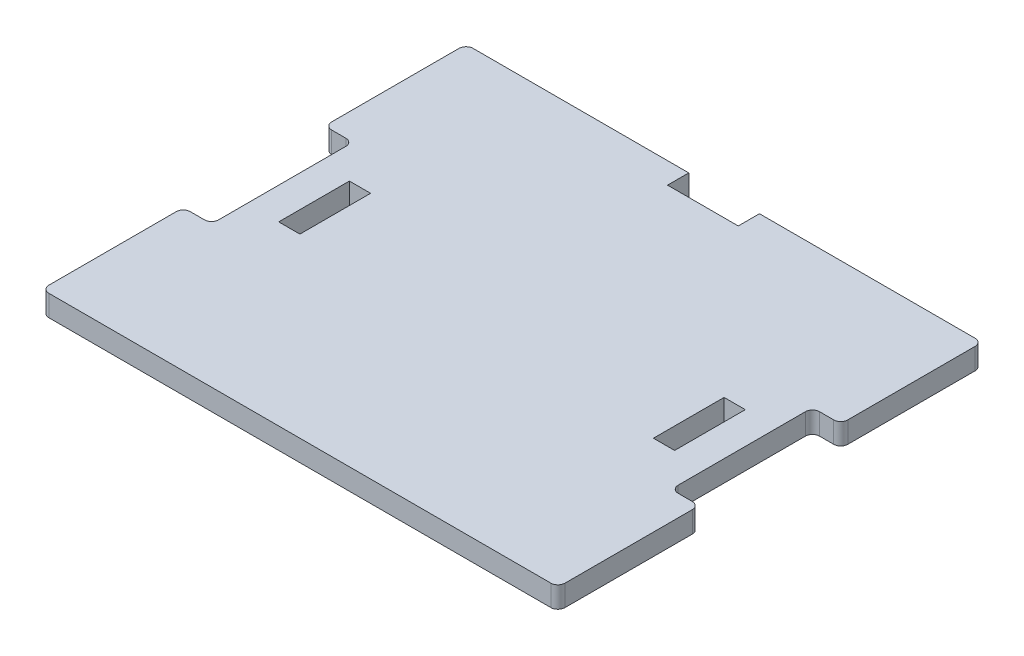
ISO-10303-21;
HEADER;
FILE_DESCRIPTION(('STEP AP214'),'2;1');
FILE_NAME('part.step','',(''),(''),'','','');
FILE_SCHEMA(('AUTOMOTIVE_DESIGN { 1 0 10303 214 1 1 1 1 }'));
ENDSEC;
DATA;
#1=APPLICATION_CONTEXT('core data for automotive mechanical design processes');
#2=APPLICATION_PROTOCOL_DEFINITION('international standard','automotive_design',2000,#1);
#3=PRODUCT_CONTEXT('',#1,'mechanical');
#4=PRODUCT('Part','Part','',(#3));
#5=PRODUCT_RELATED_PRODUCT_CATEGORY('part','',(#4));
#6=PRODUCT_DEFINITION_FORMATION('','',#4);
#7=PRODUCT_DEFINITION_CONTEXT('part definition',#1,'design');
#8=PRODUCT_DEFINITION('design','',#6,#7);
#9=PRODUCT_DEFINITION_SHAPE('','',#8);
#10=(LENGTH_UNIT() NAMED_UNIT(*) SI_UNIT(.MILLI.,.METRE.));
#11=(NAMED_UNIT(*) PLANE_ANGLE_UNIT() SI_UNIT($,.RADIAN.));
#12=(NAMED_UNIT(*) SI_UNIT($,.STERADIAN.) SOLID_ANGLE_UNIT());
#13=UNCERTAINTY_MEASURE_WITH_UNIT(LENGTH_MEASURE(1.E-05),#10,'distance_accuracy_value','');
#14=(GEOMETRIC_REPRESENTATION_CONTEXT(3) GLOBAL_UNCERTAINTY_ASSIGNED_CONTEXT((#13)) GLOBAL_UNIT_ASSIGNED_CONTEXT((#10,
#11,#12)) REPRESENTATION_CONTEXT('',''));
#15=CARTESIAN_POINT('',(0.,0.,0.));
#16=DIRECTION('',(0.,0.,1.));
#17=DIRECTION('',(1.,0.,0.));
#18=AXIS2_PLACEMENT_3D('',#15,#16,#17);
#19=CARTESIAN_POINT('',(0.,6.,-60.));
#20=DIRECTION('',(0.,0.,-1.));
#21=DIRECTION('',(-1.,0.,0.));
#22=AXIS2_PLACEMENT_3D('',#19,#20,#21);
#23=PLANE('',#22);
#24=DIRECTION('',(0.,1.,0.));
#25=VECTOR('',#24,1.);
#26=CARTESIAN_POINT('',(-10.,0.,-60.));
#27=LINE('',#26,#25);
#28=CARTESIAN_POINT('',(-10.,0.,-60.));
#29=VERTEX_POINT('',#28);
#30=CARTESIAN_POINT('',(-10.,6.,-60.));
#31=VERTEX_POINT('',#30);
#32=EDGE_CURVE('E309',#29,#31,#27,.T.);
#33=ORIENTED_EDGE('',*,*,#32,.F.);
#34=DIRECTION('',(1.,0.,0.));
#35=VECTOR('',#34,1.);
#36=CARTESIAN_POINT('',(0.,0.,-60.));
#37=LINE('',#36,#35);
#38=CARTESIAN_POINT('',(-71.,0.,-60.));
#39=VERTEX_POINT('',#38);
#40=EDGE_CURVE('E300',#39,#29,#37,.T.);
#41=ORIENTED_EDGE('',*,*,#40,.F.);
#42=DIRECTION('',(0.,-1.,0.));
#43=VECTOR('',#42,1.);
#44=CARTESIAN_POINT('',(-71.,6.,-60.));
#45=LINE('',#44,#43);
#46=CARTESIAN_POINT('',(-71.,6.,-60.));
#47=VERTEX_POINT('',#46);
#48=EDGE_CURVE('E500',#39,#47,#45,.F.);
#49=ORIENTED_EDGE('',*,*,#48,.T.);
#50=DIRECTION('',(1.,0.,0.));
#51=VECTOR('',#50,1.);
#52=CARTESIAN_POINT('',(0.,6.,-60.));
#53=LINE('',#52,#51);
#54=EDGE_CURVE('E389',#47,#31,#53,.T.);
#55=ORIENTED_EDGE('',*,*,#54,.T.);
#56=EDGE_LOOP('',(#33,#41,#49,#55));
#57=FACE_BOUND('',#56,.T.);
#58=ADVANCED_FACE('F47',(#57),#23,.T.);
#59=CARTESIAN_POINT('',(65.,6.,0.));
#60=DIRECTION('',(1.,0.,0.));
#61=DIRECTION('',(0.,0.,-1.));
#62=AXIS2_PLACEMENT_3D('',#59,#60,#61);
#63=PLANE('',#62);
#64=DIRECTION('',(0.,0.,1.));
#65=VECTOR('',#64,1.);
#66=CARTESIAN_POINT('',(65.,6.,0.));
#67=LINE('',#66,#65);
#68=CARTESIAN_POINT('',(65.,6.,-18.));
#69=VERTEX_POINT('',#68);
#70=CARTESIAN_POINT('',(65.,6.,18.));
#71=VERTEX_POINT('',#70);
#72=EDGE_CURVE('E378',#69,#71,#67,.T.);
#73=ORIENTED_EDGE('',*,*,#72,.T.);
#74=DIRECTION('',(0.,-1.,0.));
#75=VECTOR('',#74,1.);
#76=CARTESIAN_POINT('',(65.,0.,18.));
#77=LINE('',#76,#75);
#78=CARTESIAN_POINT('',(65.,0.,18.));
#79=VERTEX_POINT('',#78);
#80=EDGE_CURVE('E539',#71,#79,#77,.T.);
#81=ORIENTED_EDGE('',*,*,#80,.T.);
#82=DIRECTION('',(0.,0.,1.));
#83=VECTOR('',#82,1.);
#84=CARTESIAN_POINT('',(65.,0.,0.));
#85=LINE('',#84,#83);
#86=CARTESIAN_POINT('',(65.,0.,-18.));
#87=VERTEX_POINT('',#86);
#88=EDGE_CURVE('E377',#87,#79,#85,.T.);
#89=ORIENTED_EDGE('',*,*,#88,.F.);
#90=DIRECTION('',(0.,-1.,0.));
#91=VECTOR('',#90,1.);
#92=CARTESIAN_POINT('',(65.,6.,-18.));
#93=LINE('',#92,#91);
#94=EDGE_CURVE('E537',#87,#69,#93,.F.);
#95=ORIENTED_EDGE('',*,*,#94,.T.);
#96=EDGE_LOOP('',(#73,#81,#89,#95));
#97=FACE_BOUND('',#96,.T.);
#98=ADVANCED_FACE('F559',(#97),#63,.T.);
#99=CARTESIAN_POINT('',(0.,6.,-20.));
#100=DIRECTION('',(0.,0.,-1.));
#101=DIRECTION('',(-1.,0.,0.));
#102=AXIS2_PLACEMENT_3D('',#99,#100,#101);
#103=PLANE('',#102);
#104=DIRECTION('',(1.,0.,0.));
#105=VECTOR('',#104,1.);
#106=CARTESIAN_POINT('',(0.,0.,-20.));
#107=LINE('',#106,#105);
#108=CARTESIAN_POINT('',(67.,0.,-20.));
#109=VERTEX_POINT('',#108);
#110=CARTESIAN_POINT('',(71.,0.,-20.));
#111=VERTEX_POINT('',#110);
#112=EDGE_CURVE('E419',#109,#111,#107,.T.);
#113=ORIENTED_EDGE('',*,*,#112,.T.);
#114=DIRECTION('',(0.,-1.,0.));
#115=VECTOR('',#114,1.);
#116=CARTESIAN_POINT('',(71.,6.,-20.));
#117=LINE('',#116,#115);
#118=CARTESIAN_POINT('',(71.,6.,-20.));
#119=VERTEX_POINT('',#118);
#120=EDGE_CURVE('E530',#111,#119,#117,.F.);
#121=ORIENTED_EDGE('',*,*,#120,.T.);
#122=DIRECTION('',(1.,0.,0.));
#123=VECTOR('',#122,1.);
#124=CARTESIAN_POINT('',(0.,6.,-20.));
#125=LINE('',#124,#123);
#126=CARTESIAN_POINT('',(67.,6.,-20.));
#127=VERTEX_POINT('',#126);
#128=EDGE_CURVE('E381',#127,#119,#125,.T.);
#129=ORIENTED_EDGE('',*,*,#128,.F.);
#130=DIRECTION('',(0.,-1.,0.));
#131=VECTOR('',#130,1.);
#132=CARTESIAN_POINT('',(67.,6.,-20.));
#133=LINE('',#132,#131);
#134=EDGE_CURVE('E527',#127,#109,#133,.T.);
#135=ORIENTED_EDGE('',*,*,#134,.T.);
#136=EDGE_LOOP('',(#113,#121,#129,#135));
#137=FACE_BOUND('',#136,.T.);
#138=ADVANCED_FACE('F569',(#137),#103,.F.);
#139=CARTESIAN_POINT('',(73.,6.,0.));
#140=DIRECTION('',(-1.,0.,0.));
#141=DIRECTION('',(0.,0.,1.));
#142=AXIS2_PLACEMENT_3D('',#139,#140,#141);
#143=PLANE('',#142);
#144=DIRECTION('',(0.,0.,-1.));
#145=VECTOR('',#144,1.);
#146=CARTESIAN_POINT('',(73.,0.,0.));
#147=LINE('',#146,#145);
#148=CARTESIAN_POINT('',(73.,0.,-22.));
#149=VERTEX_POINT('',#148);
#150=CARTESIAN_POINT('',(73.,0.,-58.));
#151=VERTEX_POINT('',#150);
#152=EDGE_CURVE('E422',#149,#151,#147,.T.);
#153=ORIENTED_EDGE('',*,*,#152,.T.);
#154=DIRECTION('',(0.,-1.,0.));
#155=VECTOR('',#154,1.);
#156=CARTESIAN_POINT('',(73.,6.,-58.));
#157=LINE('',#156,#155);
#158=CARTESIAN_POINT('',(73.,6.,-58.));
#159=VERTEX_POINT('',#158);
#160=EDGE_CURVE('E525',#151,#159,#157,.F.);
#161=ORIENTED_EDGE('',*,*,#160,.T.);
#162=DIRECTION('',(0.,0.,-1.));
#163=VECTOR('',#162,1.);
#164=CARTESIAN_POINT('',(73.,6.,0.));
#165=LINE('',#164,#163);
#166=CARTESIAN_POINT('',(73.,6.,-22.));
#167=VERTEX_POINT('',#166);
#168=EDGE_CURVE('E385',#167,#159,#165,.T.);
#169=ORIENTED_EDGE('',*,*,#168,.F.);
#170=DIRECTION('',(0.,-1.,0.));
#171=VECTOR('',#170,1.);
#172=CARTESIAN_POINT('',(73.,6.,-22.));
#173=LINE('',#172,#171);
#174=EDGE_CURVE('E522',#167,#149,#173,.T.);
#175=ORIENTED_EDGE('',*,*,#174,.T.);
#176=EDGE_LOOP('',(#153,#161,#169,#175));
#177=FACE_BOUND('',#176,.T.);
#178=ADVANCED_FACE('F577',(#177),#143,.F.);
#179=DIRECTION('',(0.,1.,0.));
#180=VECTOR('',#179,1.);
#181=CARTESIAN_POINT('',(10.,0.,-60.));
#182=LINE('',#181,#180);
#183=CARTESIAN_POINT('',(10.,0.,-60.));
#184=VERTEX_POINT('',#183);
#185=CARTESIAN_POINT('',(10.,6.,-60.));
#186=VERTEX_POINT('',#185);
#187=EDGE_CURVE('E312',#184,#186,#182,.T.);
#188=ORIENTED_EDGE('',*,*,#187,.T.);
#189=CARTESIAN_POINT('',(71.,6.,-60.));
#190=VERTEX_POINT('',#189);
#191=EDGE_CURVE('E388',#186,#190,#53,.T.);
#192=ORIENTED_EDGE('',*,*,#191,.T.);
#193=DIRECTION('',(0.,-1.,0.));
#194=VECTOR('',#193,1.);
#195=CARTESIAN_POINT('',(71.,0.,-60.));
#196=LINE('',#195,#194);
#197=CARTESIAN_POINT('',(71.,0.,-60.));
#198=VERTEX_POINT('',#197);
#199=EDGE_CURVE('E497',#190,#198,#196,.T.);
#200=ORIENTED_EDGE('',*,*,#199,.T.);
#201=EDGE_CURVE('E425',#184,#198,#37,.T.);
#202=ORIENTED_EDGE('',*,*,#201,.F.);
#203=EDGE_LOOP('',(#188,#192,#200,#202));
#204=FACE_BOUND('',#203,.T.);
#205=ADVANCED_FACE('F587',(#204),#23,.T.);
#206=CARTESIAN_POINT('',(-73.,6.,0.));
#207=DIRECTION('',(-1.,0.,0.));
#208=DIRECTION('',(0.,0.,1.));
#209=AXIS2_PLACEMENT_3D('',#206,#207,#208);
#210=PLANE('',#209);
#211=DIRECTION('',(0.,0.,-1.));
#212=VECTOR('',#211,1.);
#213=CARTESIAN_POINT('',(-73.,0.,0.));
#214=LINE('',#213,#212);
#215=CARTESIAN_POINT('',(-73.,0.,-22.));
#216=VERTEX_POINT('',#215);
#217=CARTESIAN_POINT('',(-73.,0.,-58.));
#218=VERTEX_POINT('',#217);
#219=EDGE_CURVE('E427',#216,#218,#214,.T.);
#220=ORIENTED_EDGE('',*,*,#219,.F.);
#221=DIRECTION('',(0.,-1.,0.));
#222=VECTOR('',#221,1.);
#223=CARTESIAN_POINT('',(-73.,6.,-22.));
#224=LINE('',#223,#222);
#225=CARTESIAN_POINT('',(-73.,6.,-22.));
#226=VERTEX_POINT('',#225);
#227=EDGE_CURVE('E473',#216,#226,#224,.F.);
#228=ORIENTED_EDGE('',*,*,#227,.T.);
#229=DIRECTION('',(0.,0.,-1.));
#230=VECTOR('',#229,1.);
#231=CARTESIAN_POINT('',(-73.,6.,0.));
#232=LINE('',#231,#230);
#233=CARTESIAN_POINT('',(-73.,6.,-58.));
#234=VERTEX_POINT('',#233);
#235=EDGE_CURVE('E392',#226,#234,#232,.T.);
#236=ORIENTED_EDGE('',*,*,#235,.T.);
#237=DIRECTION('',(0.,-1.,0.));
#238=VECTOR('',#237,1.);
#239=CARTESIAN_POINT('',(-73.,6.,-58.));
#240=LINE('',#239,#238);
#241=EDGE_CURVE('E470',#234,#218,#240,.T.);
#242=ORIENTED_EDGE('',*,*,#241,.T.);
#243=EDGE_LOOP('',(#220,#228,#236,#242));
#244=FACE_BOUND('',#243,.T.);
#245=ADVANCED_FACE('F601',(#244),#210,.T.);
#246=CARTESIAN_POINT('',(0.,6.,-20.));
#247=DIRECTION('',(0.,0.,1.));
#248=DIRECTION('',(1.,0.,0.));
#249=AXIS2_PLACEMENT_3D('',#246,#247,#248);
#250=PLANE('',#249);
#251=DIRECTION('',(-1.,0.,0.));
#252=VECTOR('',#251,1.);
#253=CARTESIAN_POINT('',(0.,6.,-20.));
#254=LINE('',#253,#252);
#255=CARTESIAN_POINT('',(-67.,6.,-20.));
#256=VERTEX_POINT('',#255);
#257=CARTESIAN_POINT('',(-71.,6.,-20.));
#258=VERTEX_POINT('',#257);
#259=EDGE_CURVE('E395',#256,#258,#254,.T.);
#260=ORIENTED_EDGE('',*,*,#259,.T.);
#261=DIRECTION('',(0.,-1.,0.));
#262=VECTOR('',#261,1.);
#263=CARTESIAN_POINT('',(-71.,6.,-20.));
#264=LINE('',#263,#262);
#265=CARTESIAN_POINT('',(-71.,0.,-20.));
#266=VERTEX_POINT('',#265);
#267=EDGE_CURVE('E451',#258,#266,#264,.T.);
#268=ORIENTED_EDGE('',*,*,#267,.T.);
#269=DIRECTION('',(-1.,0.,0.));
#270=VECTOR('',#269,1.);
#271=CARTESIAN_POINT('',(0.,0.,-20.));
#272=LINE('',#271,#270);
#273=CARTESIAN_POINT('',(-67.,0.,-20.));
#274=VERTEX_POINT('',#273);
#275=EDGE_CURVE('E430',#274,#266,#272,.T.);
#276=ORIENTED_EDGE('',*,*,#275,.F.);
#277=DIRECTION('',(0.,-1.,0.));
#278=VECTOR('',#277,1.);
#279=CARTESIAN_POINT('',(-67.,6.,-20.));
#280=LINE('',#279,#278);
#281=EDGE_CURVE('E416',#274,#256,#280,.F.);
#282=ORIENTED_EDGE('',*,*,#281,.T.);
#283=EDGE_LOOP('',(#260,#268,#276,#282));
#284=FACE_BOUND('',#283,.T.);
#285=ADVANCED_FACE('F609',(#284),#250,.T.);
#286=CARTESIAN_POINT('',(-65.,6.,0.));
#287=DIRECTION('',(1.,0.,0.));
#288=DIRECTION('',(0.,0.,-1.));
#289=AXIS2_PLACEMENT_3D('',#286,#287,#288);
#290=PLANE('',#289);
#291=DIRECTION('',(0.,0.,1.));
#292=VECTOR('',#291,1.);
#293=CARTESIAN_POINT('',(-65.,6.,0.));
#294=LINE('',#293,#292);
#295=CARTESIAN_POINT('',(-65.,6.,-18.));
#296=VERTEX_POINT('',#295);
#297=CARTESIAN_POINT('',(-65.,6.,18.));
#298=VERTEX_POINT('',#297);
#299=EDGE_CURVE('E398',#296,#298,#294,.T.);
#300=ORIENTED_EDGE('',*,*,#299,.F.);
#301=DIRECTION('',(0.,-1.,0.));
#302=VECTOR('',#301,1.);
#303=CARTESIAN_POINT('',(-65.,6.,-18.));
#304=LINE('',#303,#302);
#305=CARTESIAN_POINT('',(-65.,0.,-18.));
#306=VERTEX_POINT('',#305);
#307=EDGE_CURVE('E494',#296,#306,#304,.T.);
#308=ORIENTED_EDGE('',*,*,#307,.T.);
#309=DIRECTION('',(0.,0.,1.));
#310=VECTOR('',#309,1.);
#311=CARTESIAN_POINT('',(-65.,0.,0.));
#312=LINE('',#311,#310);
#313=CARTESIAN_POINT('',(-65.,0.,18.));
#314=VERTEX_POINT('',#313);
#315=EDGE_CURVE('E433',#306,#314,#312,.T.);
#316=ORIENTED_EDGE('',*,*,#315,.T.);
#317=DIRECTION('',(0.,-1.,0.));
#318=VECTOR('',#317,1.);
#319=CARTESIAN_POINT('',(-65.,6.,18.));
#320=LINE('',#319,#318);
#321=EDGE_CURVE('E492',#314,#298,#320,.F.);
#322=ORIENTED_EDGE('',*,*,#321,.T.);
#323=EDGE_LOOP('',(#300,#308,#316,#322));
#324=FACE_BOUND('',#323,.T.);
#325=ADVANCED_FACE('F618',(#324),#290,.F.);
#326=CARTESIAN_POINT('',(0.,6.,19.9999999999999));
#327=DIRECTION('',(0.,0.,1.));
#328=DIRECTION('',(1.,0.,0.));
#329=AXIS2_PLACEMENT_3D('',#326,#327,#328);
#330=PLANE('',#329);
#331=DIRECTION('',(-1.,0.,0.));
#332=VECTOR('',#331,1.);
#333=CARTESIAN_POINT('',(0.,0.,19.9999999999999));
#334=LINE('',#333,#332);
#335=CARTESIAN_POINT('',(-67.,0.,20.));
#336=VERTEX_POINT('',#335);
#337=CARTESIAN_POINT('',(-71.,0.,20.));
#338=VERTEX_POINT('',#337);
#339=EDGE_CURVE('E436',#336,#338,#334,.T.);
#340=ORIENTED_EDGE('',*,*,#339,.T.);
#341=DIRECTION('',(0.,-1.,0.));
#342=VECTOR('',#341,1.);
#343=CARTESIAN_POINT('',(-71.,6.,20.));
#344=LINE('',#343,#342);
#345=CARTESIAN_POINT('',(-71.,6.,20.));
#346=VERTEX_POINT('',#345);
#347=EDGE_CURVE('E510',#338,#346,#344,.F.);
#348=ORIENTED_EDGE('',*,*,#347,.T.);
#349=DIRECTION('',(-1.,0.,0.));
#350=VECTOR('',#349,1.);
#351=CARTESIAN_POINT('',(0.,6.,19.9999999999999));
#352=LINE('',#351,#350);
#353=CARTESIAN_POINT('',(-67.,6.,20.));
#354=VERTEX_POINT('',#353);
#355=EDGE_CURVE('E401',#354,#346,#352,.T.);
#356=ORIENTED_EDGE('',*,*,#355,.F.);
#357=DIRECTION('',(0.,-1.,0.));
#358=VECTOR('',#357,1.);
#359=CARTESIAN_POINT('',(-67.,0.,20.));
#360=LINE('',#359,#358);
#361=EDGE_CURVE('E507',#354,#336,#360,.T.);
#362=ORIENTED_EDGE('',*,*,#361,.T.);
#363=EDGE_LOOP('',(#340,#348,#356,#362));
#364=FACE_BOUND('',#363,.T.);
#365=ADVANCED_FACE('F627',(#364),#330,.F.);
#366=CARTESIAN_POINT('',(-73.,6.,0.));
#367=DIRECTION('',(1.,0.,0.));
#368=DIRECTION('',(0.,0.,-1.));
#369=AXIS2_PLACEMENT_3D('',#366,#367,#368);
#370=PLANE('',#369);
#371=DIRECTION('',(0.,0.,1.));
#372=VECTOR('',#371,1.);
#373=CARTESIAN_POINT('',(-73.,6.,0.));
#374=LINE('',#373,#372);
#375=CARTESIAN_POINT('',(-73.,6.,22.));
#376=VERTEX_POINT('',#375);
#377=CARTESIAN_POINT('',(-73.,6.,58.));
#378=VERTEX_POINT('',#377);
#379=EDGE_CURVE('E404',#376,#378,#374,.T.);
#380=ORIENTED_EDGE('',*,*,#379,.F.);
#381=DIRECTION('',(0.,-1.,0.));
#382=VECTOR('',#381,1.);
#383=CARTESIAN_POINT('',(-73.,6.,22.));
#384=LINE('',#383,#382);
#385=CARTESIAN_POINT('',(-73.,0.,22.));
#386=VERTEX_POINT('',#385);
#387=EDGE_CURVE('E504',#376,#386,#384,.T.);
#388=ORIENTED_EDGE('',*,*,#387,.T.);
#389=DIRECTION('',(0.,0.,1.));
#390=VECTOR('',#389,1.);
#391=CARTESIAN_POINT('',(-73.,0.,0.));
#392=LINE('',#391,#390);
#393=CARTESIAN_POINT('',(-73.,0.,58.));
#394=VERTEX_POINT('',#393);
#395=EDGE_CURVE('E439',#386,#394,#392,.T.);
#396=ORIENTED_EDGE('',*,*,#395,.T.);
#397=DIRECTION('',(0.,-1.,0.));
#398=VECTOR('',#397,1.);
#399=CARTESIAN_POINT('',(-73.,6.,58.));
#400=LINE('',#399,#398);
#401=EDGE_CURVE('E502',#394,#378,#400,.F.);
#402=ORIENTED_EDGE('',*,*,#401,.T.);
#403=EDGE_LOOP('',(#380,#388,#396,#402));
#404=FACE_BOUND('',#403,.T.);
#405=ADVANCED_FACE('F636',(#404),#370,.F.);
#406=CARTESIAN_POINT('',(0.,6.,60.));
#407=DIRECTION('',(0.,0.,-1.));
#408=DIRECTION('',(-1.,0.,0.));
#409=AXIS2_PLACEMENT_3D('',#406,#407,#408);
#410=PLANE('',#409);
#411=DIRECTION('',(1.,0.,0.));
#412=VECTOR('',#411,1.);
#413=CARTESIAN_POINT('',(0.,6.,60.));
#414=LINE('',#413,#412);
#415=CARTESIAN_POINT('',(-71.,6.,60.));
#416=VERTEX_POINT('',#415);
#417=CARTESIAN_POINT('',(71.,6.,60.));
#418=VERTEX_POINT('',#417);
#419=EDGE_CURVE('E407',#416,#418,#414,.T.);
#420=ORIENTED_EDGE('',*,*,#419,.F.);
#421=DIRECTION('',(0.,-1.,0.));
#422=VECTOR('',#421,1.);
#423=CARTESIAN_POINT('',(-71.,6.,60.));
#424=LINE('',#423,#422);
#425=CARTESIAN_POINT('',(-71.,0.,60.));
#426=VERTEX_POINT('',#425);
#427=EDGE_CURVE('E514',#416,#426,#424,.T.);
#428=ORIENTED_EDGE('',*,*,#427,.T.);
#429=DIRECTION('',(1.,0.,0.));
#430=VECTOR('',#429,1.);
#431=CARTESIAN_POINT('',(0.,0.,60.));
#432=LINE('',#431,#430);
#433=CARTESIAN_POINT('',(71.,0.,60.));
#434=VERTEX_POINT('',#433);
#435=EDGE_CURVE('E442',#426,#434,#432,.T.);
#436=ORIENTED_EDGE('',*,*,#435,.T.);
#437=DIRECTION('',(0.,-1.,0.));
#438=VECTOR('',#437,1.);
#439=CARTESIAN_POINT('',(71.,6.,60.));
#440=LINE('',#439,#438);
#441=EDGE_CURVE('E512',#434,#418,#440,.F.);
#442=ORIENTED_EDGE('',*,*,#441,.T.);
#443=EDGE_LOOP('',(#420,#428,#436,#442));
#444=FACE_BOUND('',#443,.T.);
#445=ADVANCED_FACE('F645',(#444),#410,.F.);
#446=CARTESIAN_POINT('',(73.,6.,0.));
#447=DIRECTION('',(1.,0.,0.));
#448=DIRECTION('',(0.,0.,-1.));
#449=AXIS2_PLACEMENT_3D('',#446,#447,#448);
#450=PLANE('',#449);
#451=DIRECTION('',(0.,0.,1.));
#452=VECTOR('',#451,1.);
#453=CARTESIAN_POINT('',(73.,6.,0.));
#454=LINE('',#453,#452);
#455=CARTESIAN_POINT('',(73.,6.,22.));
#456=VERTEX_POINT('',#455);
#457=CARTESIAN_POINT('',(73.,6.,58.));
#458=VERTEX_POINT('',#457);
#459=EDGE_CURVE('E410',#456,#458,#454,.T.);
#460=ORIENTED_EDGE('',*,*,#459,.T.);
#461=DIRECTION('',(0.,-1.,0.));
#462=VECTOR('',#461,1.);
#463=CARTESIAN_POINT('',(73.,0.,58.));
#464=LINE('',#463,#462);
#465=CARTESIAN_POINT('',(73.,0.,58.));
#466=VERTEX_POINT('',#465);
#467=EDGE_CURVE('E519',#458,#466,#464,.T.);
#468=ORIENTED_EDGE('',*,*,#467,.T.);
#469=DIRECTION('',(0.,0.,1.));
#470=VECTOR('',#469,1.);
#471=CARTESIAN_POINT('',(73.,0.,0.));
#472=LINE('',#471,#470);
#473=CARTESIAN_POINT('',(73.,0.,22.));
#474=VERTEX_POINT('',#473);
#475=EDGE_CURVE('E445',#474,#466,#472,.T.);
#476=ORIENTED_EDGE('',*,*,#475,.F.);
#477=DIRECTION('',(0.,-1.,0.));
#478=VECTOR('',#477,1.);
#479=CARTESIAN_POINT('',(73.,6.,22.));
#480=LINE('',#479,#478);
#481=EDGE_CURVE('E517',#474,#456,#480,.F.);
#482=ORIENTED_EDGE('',*,*,#481,.T.);
#483=EDGE_LOOP('',(#460,#468,#476,#482));
#484=FACE_BOUND('',#483,.T.);
#485=ADVANCED_FACE('F654',(#484),#450,.T.);
#486=CARTESIAN_POINT('',(0.,6.,19.9999999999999));
#487=DIRECTION('',(0.,0.,-1.));
#488=DIRECTION('',(-1.,0.,0.));
#489=AXIS2_PLACEMENT_3D('',#486,#487,#488);
#490=PLANE('',#489);
#491=DIRECTION('',(1.,0.,0.));
#492=VECTOR('',#491,1.);
#493=CARTESIAN_POINT('',(0.,6.,19.9999999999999));
#494=LINE('',#493,#492);
#495=CARTESIAN_POINT('',(67.,6.,20.));
#496=VERTEX_POINT('',#495);
#497=CARTESIAN_POINT('',(71.,6.,20.));
#498=VERTEX_POINT('',#497);
#499=EDGE_CURVE('E413',#496,#498,#494,.T.);
#500=ORIENTED_EDGE('',*,*,#499,.T.);
#501=DIRECTION('',(0.,-1.,0.));
#502=VECTOR('',#501,1.);
#503=CARTESIAN_POINT('',(71.,6.,20.));
#504=LINE('',#503,#502);
#505=CARTESIAN_POINT('',(71.,0.,20.));
#506=VERTEX_POINT('',#505);
#507=EDGE_CURVE('E534',#498,#506,#504,.T.);
#508=ORIENTED_EDGE('',*,*,#507,.T.);
#509=DIRECTION('',(1.,0.,0.));
#510=VECTOR('',#509,1.);
#511=CARTESIAN_POINT('',(0.,0.,19.9999999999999));
#512=LINE('',#511,#510);
#513=CARTESIAN_POINT('',(67.,0.,20.));
#514=VERTEX_POINT('',#513);
#515=EDGE_CURVE('E382',#514,#506,#512,.T.);
#516=ORIENTED_EDGE('',*,*,#515,.F.);
#517=DIRECTION('',(0.,-1.,0.));
#518=VECTOR('',#517,1.);
#519=CARTESIAN_POINT('',(67.,6.,20.));
#520=LINE('',#519,#518);
#521=EDGE_CURVE('E532',#514,#496,#520,.F.);
#522=ORIENTED_EDGE('',*,*,#521,.T.);
#523=EDGE_LOOP('',(#500,#508,#516,#522));
#524=FACE_BOUND('',#523,.T.);
#525=ADVANCED_FACE('F663',(#524),#490,.T.);
#526=CARTESIAN_POINT('',(0.,6.,0.));
#527=DIRECTION('',(0.,1.,0.));
#528=DIRECTION('',(0.,0.,1.));
#529=AXIS2_PLACEMENT_3D('',#526,#527,#528);
#530=PLANE('',#529);
#531=DIRECTION('',(0.,0.,1.));
#532=VECTOR('',#531,1.);
#533=CARTESIAN_POINT('',(-10.,6.,-60.));
#534=LINE('',#533,#532);
#535=CARTESIAN_POINT('',(-9.99999999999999,6.,-54.));
#536=VERTEX_POINT('',#535);
#537=EDGE_CURVE('E285',#31,#536,#534,.T.);
#538=ORIENTED_EDGE('',*,*,#537,.F.);
#539=ORIENTED_EDGE('',*,*,#54,.F.);
#540=CARTESIAN_POINT('',(-71.,6.,-58.));
#541=DIRECTION('',(0.,1.,0.));
#542=DIRECTION('',(0.,0.,1.));
#543=AXIS2_PLACEMENT_3D('',#540,#541,#542);
#544=CIRCLE('',#543,2.);
#545=EDGE_CURVE('E488',#47,#234,#544,.T.);
#546=ORIENTED_EDGE('',*,*,#545,.T.);
#547=ORIENTED_EDGE('',*,*,#235,.F.);
#548=CARTESIAN_POINT('',(-71.,6.,-22.));
#549=DIRECTION('',(0.,1.,0.));
#550=DIRECTION('',(0.,0.,1.));
#551=AXIS2_PLACEMENT_3D('',#548,#549,#550);
#552=CIRCLE('',#551,2.);
#553=EDGE_CURVE('E490',#226,#258,#552,.T.);
#554=ORIENTED_EDGE('',*,*,#553,.T.);
#555=ORIENTED_EDGE('',*,*,#259,.F.);
#556=CARTESIAN_POINT('',(-67.,6.,-18.));
#557=DIRECTION('',(0.,1.,0.));
#558=DIRECTION('',(0.,0.,1.));
#559=AXIS2_PLACEMENT_3D('',#556,#557,#558);
#560=CIRCLE('',#559,2.);
#561=EDGE_CURVE('E544',#256,#296,#560,.F.);
#562=ORIENTED_EDGE('',*,*,#561,.T.);
#563=ORIENTED_EDGE('',*,*,#299,.T.);
#564=CARTESIAN_POINT('',(-67.,6.,18.));
#565=DIRECTION('',(0.,1.,0.));
#566=DIRECTION('',(0.,0.,1.));
#567=AXIS2_PLACEMENT_3D('',#564,#565,#566);
#568=CIRCLE('',#567,2.);
#569=EDGE_CURVE('E548',#298,#354,#568,.F.);
#570=ORIENTED_EDGE('',*,*,#569,.T.);
#571=ORIENTED_EDGE('',*,*,#355,.T.);
#572=CARTESIAN_POINT('',(-71.,6.,22.));
#573=DIRECTION('',(0.,1.,0.));
#574=DIRECTION('',(0.,0.,1.));
#575=AXIS2_PLACEMENT_3D('',#572,#573,#574);
#576=CIRCLE('',#575,2.);
#577=EDGE_CURVE('E486',#346,#376,#576,.T.);
#578=ORIENTED_EDGE('',*,*,#577,.T.);
#579=ORIENTED_EDGE('',*,*,#379,.T.);
#580=CARTESIAN_POINT('',(-71.,6.,58.));
#581=DIRECTION('',(0.,1.,0.));
#582=DIRECTION('',(0.,0.,1.));
#583=AXIS2_PLACEMENT_3D('',#580,#581,#582);
#584=CIRCLE('',#583,2.);
#585=EDGE_CURVE('E484',#378,#416,#584,.T.);
#586=ORIENTED_EDGE('',*,*,#585,.T.);
#587=ORIENTED_EDGE('',*,*,#419,.T.);
#588=CARTESIAN_POINT('',(71.,6.,58.));
#589=DIRECTION('',(0.,1.,0.));
#590=DIRECTION('',(0.,0.,1.));
#591=AXIS2_PLACEMENT_3D('',#588,#589,#590);
#592=CIRCLE('',#591,2.);
#593=EDGE_CURVE('E482',#418,#458,#592,.T.);
#594=ORIENTED_EDGE('',*,*,#593,.T.);
#595=ORIENTED_EDGE('',*,*,#459,.F.);
#596=CARTESIAN_POINT('',(71.,6.,22.));
#597=DIRECTION('',(0.,1.,0.));
#598=DIRECTION('',(0.,0.,1.));
#599=AXIS2_PLACEMENT_3D('',#596,#597,#598);
#600=CIRCLE('',#599,2.);
#601=EDGE_CURVE('E475',#456,#498,#600,.T.);
#602=ORIENTED_EDGE('',*,*,#601,.T.);
#603=ORIENTED_EDGE('',*,*,#499,.F.);
#604=CARTESIAN_POINT('',(67.,6.,18.));
#605=DIRECTION('',(0.,1.,0.));
#606=DIRECTION('',(0.,0.,1.));
#607=AXIS2_PLACEMENT_3D('',#604,#605,#606);
#608=CIRCLE('',#607,2.);
#609=EDGE_CURVE('E552',#496,#71,#608,.F.);
#610=ORIENTED_EDGE('',*,*,#609,.T.);
#611=ORIENTED_EDGE('',*,*,#72,.F.);
#612=CARTESIAN_POINT('',(67.,6.,-18.));
#613=DIRECTION('',(0.,1.,0.));
#614=DIRECTION('',(0.,0.,1.));
#615=AXIS2_PLACEMENT_3D('',#612,#613,#614);
#616=CIRCLE('',#615,2.);
#617=EDGE_CURVE('E11',#69,#127,#616,.F.);
#618=ORIENTED_EDGE('',*,*,#617,.T.);
#619=ORIENTED_EDGE('',*,*,#128,.T.);
#620=CARTESIAN_POINT('',(71.,6.,-22.));
#621=DIRECTION('',(0.,1.,0.));
#622=DIRECTION('',(0.,0.,1.));
#623=AXIS2_PLACEMENT_3D('',#620,#621,#622);
#624=CIRCLE('',#623,2.);
#625=EDGE_CURVE('E477',#119,#167,#624,.T.);
#626=ORIENTED_EDGE('',*,*,#625,.T.);
#627=ORIENTED_EDGE('',*,*,#168,.T.);
#628=CARTESIAN_POINT('',(71.,6.,-58.));
#629=DIRECTION('',(0.,1.,0.));
#630=DIRECTION('',(0.,0.,1.));
#631=AXIS2_PLACEMENT_3D('',#628,#629,#630);
#632=CIRCLE('',#631,2.);
#633=EDGE_CURVE('E479',#159,#190,#632,.T.);
#634=ORIENTED_EDGE('',*,*,#633,.T.);
#635=ORIENTED_EDGE('',*,*,#191,.F.);
#636=DIRECTION('',(0.,0.,-1.));
#637=VECTOR('',#636,1.);
#638=CARTESIAN_POINT('',(10.,6.,-60.));
#639=LINE('',#638,#637);
#640=CARTESIAN_POINT('',(10.,6.,-54.));
#641=VERTEX_POINT('',#640);
#642=EDGE_CURVE('E301',#641,#186,#639,.T.);
#643=ORIENTED_EDGE('',*,*,#642,.F.);
#644=DIRECTION('',(1.,0.,0.));
#645=VECTOR('',#644,1.);
#646=CARTESIAN_POINT('',(-9.99999999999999,6.,-54.));
#647=LINE('',#646,#645);
#648=EDGE_CURVE('E303',#536,#641,#647,.T.);
#649=ORIENTED_EDGE('',*,*,#648,.F.);
#650=EDGE_LOOP('',(#538,#539,#546,#547,#554,#555,#562,#563,#570,#571,#578,#579,#586,#587,#594,
#595,#602,#603,#610,#611,#618,#619,#626,#627,#634,#635,#643,#649));
#651=FACE_BOUND('',#650,.T.);
#652=DIRECTION('',(0.,0.,1.));
#653=VECTOR('',#652,1.);
#654=CARTESIAN_POINT('',(50.,6.,0.));
#655=LINE('',#654,#653);
#656=CARTESIAN_POINT('',(50.,6.,-10.));
#657=VERTEX_POINT('',#656);
#658=CARTESIAN_POINT('',(50.,6.,10.));
#659=VERTEX_POINT('',#658);
#660=EDGE_CURVE('E375',#657,#659,#655,.T.);
#661=ORIENTED_EDGE('',*,*,#660,.F.);
#662=DIRECTION('',(-1.,0.,0.));
#663=VECTOR('',#662,1.);
#664=CARTESIAN_POINT('',(0.,6.,-10.));
#665=LINE('',#664,#663);
#666=CARTESIAN_POINT('',(56.,6.,-10.));
#667=VERTEX_POINT('',#666);
#668=EDGE_CURVE('E373',#667,#657,#665,.T.);
#669=ORIENTED_EDGE('',*,*,#668,.F.);
#670=DIRECTION('',(0.,0.,-1.));
#671=VECTOR('',#670,1.);
#672=CARTESIAN_POINT('',(56.,6.,0.));
#673=LINE('',#672,#671);
#674=CARTESIAN_POINT('',(56.,6.,10.));
#675=VERTEX_POINT('',#674);
#676=EDGE_CURVE('E371',#675,#667,#673,.T.);
#677=ORIENTED_EDGE('',*,*,#676,.F.);
#678=DIRECTION('',(1.,0.,0.));
#679=VECTOR('',#678,1.);
#680=CARTESIAN_POINT('',(0.,6.,10.));
#681=LINE('',#680,#679);
#682=EDGE_CURVE('E369',#659,#675,#681,.T.);
#683=ORIENTED_EDGE('',*,*,#682,.F.);
#684=EDGE_LOOP('',(#661,#669,#677,#683));
#685=FACE_BOUND('',#684,.T.);
#686=DIRECTION('',(0.,0.,-1.));
#687=VECTOR('',#686,1.);
#688=CARTESIAN_POINT('',(-50.,6.,0.));
#689=LINE('',#688,#687);
#690=CARTESIAN_POINT('',(-50.,6.,10.));
#691=VERTEX_POINT('',#690);
#692=CARTESIAN_POINT('',(-50.,6.,-10.));
#693=VERTEX_POINT('',#692);
#694=EDGE_CURVE('E366',#691,#693,#689,.T.);
#695=ORIENTED_EDGE('',*,*,#694,.F.);
#696=DIRECTION('',(1.,0.,0.));
#697=VECTOR('',#696,1.);
#698=CARTESIAN_POINT('',(0.,6.,10.));
#699=LINE('',#698,#697);
#700=CARTESIAN_POINT('',(-56.,6.,10.));
#701=VERTEX_POINT('',#700);
#702=EDGE_CURVE('E364',#701,#691,#699,.T.);
#703=ORIENTED_EDGE('',*,*,#702,.F.);
#704=DIRECTION('',(0.,0.,1.));
#705=VECTOR('',#704,1.);
#706=CARTESIAN_POINT('',(-56.,6.,0.));
#707=LINE('',#706,#705);
#708=CARTESIAN_POINT('',(-56.,6.,-10.));
#709=VERTEX_POINT('',#708);
#710=EDGE_CURVE('E362',#709,#701,#707,.T.);
#711=ORIENTED_EDGE('',*,*,#710,.F.);
#712=DIRECTION('',(-1.,0.,0.));
#713=VECTOR('',#712,1.);
#714=CARTESIAN_POINT('',(0.,6.,-10.));
#715=LINE('',#714,#713);
#716=EDGE_CURVE('E332',#693,#709,#715,.T.);
#717=ORIENTED_EDGE('',*,*,#716,.F.);
#718=EDGE_LOOP('',(#695,#703,#711,#717));
#719=FACE_BOUND('',#718,.T.);
#720=ADVANCED_FACE('F565',(#651,#685,#719),#530,.T.);
#721=CARTESIAN_POINT('',(0.,0.,0.));
#722=DIRECTION('',(0.,1.,0.));
#723=DIRECTION('',(0.,0.,1.));
#724=AXIS2_PLACEMENT_3D('',#721,#722,#723);
#725=PLANE('',#724);
#726=ORIENTED_EDGE('',*,*,#40,.T.);
#727=DIRECTION('',(0.,0.,1.));
#728=VECTOR('',#727,1.);
#729=CARTESIAN_POINT('',(-10.,0.,-60.));
#730=LINE('',#729,#728);
#731=CARTESIAN_POINT('',(-9.99999999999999,0.,-54.));
#732=VERTEX_POINT('',#731);
#733=EDGE_CURVE('E282',#29,#732,#730,.T.);
#734=ORIENTED_EDGE('',*,*,#733,.T.);
#735=DIRECTION('',(1.,0.,0.));
#736=VECTOR('',#735,1.);
#737=CARTESIAN_POINT('',(-9.99999999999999,0.,-54.));
#738=LINE('',#737,#736);
#739=CARTESIAN_POINT('',(10.,0.,-54.));
#740=VERTEX_POINT('',#739);
#741=EDGE_CURVE('E292',#732,#740,#738,.T.);
#742=ORIENTED_EDGE('',*,*,#741,.T.);
#743=DIRECTION('',(0.,0.,-1.));
#744=VECTOR('',#743,1.);
#745=CARTESIAN_POINT('',(10.,0.,-60.));
#746=LINE('',#745,#744);
#747=EDGE_CURVE('E62',#740,#184,#746,.T.);
#748=ORIENTED_EDGE('',*,*,#747,.T.);
#749=ORIENTED_EDGE('',*,*,#201,.T.);
#750=CARTESIAN_POINT('',(71.,0.,-58.));
#751=DIRECTION('',(0.,1.,0.));
#752=DIRECTION('',(0.,0.,1.));
#753=AXIS2_PLACEMENT_3D('',#750,#751,#752);
#754=CIRCLE('',#753,2.);
#755=EDGE_CURVE('E458',#198,#151,#754,.F.);
#756=ORIENTED_EDGE('',*,*,#755,.T.);
#757=ORIENTED_EDGE('',*,*,#152,.F.);
#758=CARTESIAN_POINT('',(71.,0.,-22.));
#759=DIRECTION('',(0.,1.,0.));
#760=DIRECTION('',(0.,0.,1.));
#761=AXIS2_PLACEMENT_3D('',#758,#759,#760);
#762=CIRCLE('',#761,2.);
#763=EDGE_CURVE('E456',#149,#111,#762,.F.);
#764=ORIENTED_EDGE('',*,*,#763,.T.);
#765=ORIENTED_EDGE('',*,*,#112,.F.);
#766=CARTESIAN_POINT('',(67.,0.,-18.));
#767=DIRECTION('',(0.,1.,0.));
#768=DIRECTION('',(0.,0.,1.));
#769=AXIS2_PLACEMENT_3D('',#766,#767,#768);
#770=CIRCLE('',#769,2.);
#771=EDGE_CURVE('E55',#109,#87,#770,.T.);
#772=ORIENTED_EDGE('',*,*,#771,.T.);
#773=ORIENTED_EDGE('',*,*,#88,.T.);
#774=CARTESIAN_POINT('',(67.,0.,18.));
#775=DIRECTION('',(0.,1.,0.));
#776=DIRECTION('',(0.,0.,1.));
#777=AXIS2_PLACEMENT_3D('',#774,#775,#776);
#778=CIRCLE('',#777,2.);
#779=EDGE_CURVE('E550',#79,#514,#778,.T.);
#780=ORIENTED_EDGE('',*,*,#779,.T.);
#781=ORIENTED_EDGE('',*,*,#515,.T.);
#782=CARTESIAN_POINT('',(71.,0.,22.));
#783=DIRECTION('',(0.,1.,0.));
#784=DIRECTION('',(0.,0.,1.));
#785=AXIS2_PLACEMENT_3D('',#782,#783,#784);
#786=CIRCLE('',#785,2.);
#787=EDGE_CURVE('E454',#506,#474,#786,.F.);
#788=ORIENTED_EDGE('',*,*,#787,.T.);
#789=ORIENTED_EDGE('',*,*,#475,.T.);
#790=CARTESIAN_POINT('',(71.,0.,58.));
#791=DIRECTION('',(0.,1.,0.));
#792=DIRECTION('',(0.,0.,1.));
#793=AXIS2_PLACEMENT_3D('',#790,#791,#792);
#794=CIRCLE('',#793,2.);
#795=EDGE_CURVE('E460',#466,#434,#794,.F.);
#796=ORIENTED_EDGE('',*,*,#795,.T.);
#797=ORIENTED_EDGE('',*,*,#435,.F.);
#798=CARTESIAN_POINT('',(-71.,0.,58.));
#799=DIRECTION('',(0.,1.,0.));
#800=DIRECTION('',(0.,0.,1.));
#801=AXIS2_PLACEMENT_3D('',#798,#799,#800);
#802=CIRCLE('',#801,2.);
#803=EDGE_CURVE('E462',#426,#394,#802,.F.);
#804=ORIENTED_EDGE('',*,*,#803,.T.);
#805=ORIENTED_EDGE('',*,*,#395,.F.);
#806=CARTESIAN_POINT('',(-71.,0.,22.));
#807=DIRECTION('',(0.,1.,0.));
#808=DIRECTION('',(0.,0.,1.));
#809=AXIS2_PLACEMENT_3D('',#806,#807,#808);
#810=CIRCLE('',#809,2.);
#811=EDGE_CURVE('E464',#386,#338,#810,.F.);
#812=ORIENTED_EDGE('',*,*,#811,.T.);
#813=ORIENTED_EDGE('',*,*,#339,.F.);
#814=CARTESIAN_POINT('',(-67.,0.,18.));
#815=DIRECTION('',(0.,1.,0.));
#816=DIRECTION('',(0.,0.,1.));
#817=AXIS2_PLACEMENT_3D('',#814,#815,#816);
#818=CIRCLE('',#817,2.);
#819=EDGE_CURVE('E546',#336,#314,#818,.T.);
#820=ORIENTED_EDGE('',*,*,#819,.T.);
#821=ORIENTED_EDGE('',*,*,#315,.F.);
#822=CARTESIAN_POINT('',(-67.,0.,-18.));
#823=DIRECTION('',(0.,1.,0.));
#824=DIRECTION('',(0.,0.,1.));
#825=AXIS2_PLACEMENT_3D('',#822,#823,#824);
#826=CIRCLE('',#825,2.);
#827=EDGE_CURVE('E542',#306,#274,#826,.T.);
#828=ORIENTED_EDGE('',*,*,#827,.T.);
#829=ORIENTED_EDGE('',*,*,#275,.T.);
#830=CARTESIAN_POINT('',(-71.,0.,-22.));
#831=DIRECTION('',(0.,1.,0.));
#832=DIRECTION('',(0.,0.,1.));
#833=AXIS2_PLACEMENT_3D('',#830,#831,#832);
#834=CIRCLE('',#833,2.);
#835=EDGE_CURVE('E468',#266,#216,#834,.F.);
#836=ORIENTED_EDGE('',*,*,#835,.T.);
#837=ORIENTED_EDGE('',*,*,#219,.T.);
#838=CARTESIAN_POINT('',(-71.,0.,-58.));
#839=DIRECTION('',(0.,1.,0.));
#840=DIRECTION('',(0.,0.,1.));
#841=AXIS2_PLACEMENT_3D('',#838,#839,#840);
#842=CIRCLE('',#841,2.);
#843=EDGE_CURVE('E466',#218,#39,#842,.F.);
#844=ORIENTED_EDGE('',*,*,#843,.T.);
#845=EDGE_LOOP('',(#726,#734,#742,#748,#749,#756,#757,#764,#765,#772,#773,#780,#781,#788,#789,
#796,#797,#804,#805,#812,#813,#820,#821,#828,#829,#836,#837,#844));
#846=FACE_BOUND('',#845,.T.);
#847=DIRECTION('',(-1.,0.,0.));
#848=VECTOR('',#847,1.);
#849=CARTESIAN_POINT('',(50.,0.,-10.));
#850=LINE('',#849,#848);
#851=CARTESIAN_POINT('',(56.,0.,-10.));
#852=VERTEX_POINT('',#851);
#853=CARTESIAN_POINT('',(50.,0.,-10.));
#854=VERTEX_POINT('',#853);
#855=EDGE_CURVE('E326',#852,#854,#850,.T.);
#856=ORIENTED_EDGE('',*,*,#855,.T.);
#857=DIRECTION('',(0.,0.,1.));
#858=VECTOR('',#857,1.);
#859=CARTESIAN_POINT('',(50.,0.,-10.));
#860=LINE('',#859,#858);
#861=CARTESIAN_POINT('',(50.,0.,10.));
#862=VERTEX_POINT('',#861);
#863=EDGE_CURVE('E316',#854,#862,#860,.T.);
#864=ORIENTED_EDGE('',*,*,#863,.T.);
#865=DIRECTION('',(1.,0.,0.));
#866=VECTOR('',#865,1.);
#867=CARTESIAN_POINT('',(50.,0.,10.));
#868=LINE('',#867,#866);
#869=CARTESIAN_POINT('',(56.,0.,10.));
#870=VERTEX_POINT('',#869);
#871=EDGE_CURVE('E319',#862,#870,#868,.T.);
#872=ORIENTED_EDGE('',*,*,#871,.T.);
#873=DIRECTION('',(0.,0.,-1.));
#874=VECTOR('',#873,1.);
#875=CARTESIAN_POINT('',(56.,0.,-10.));
#876=LINE('',#875,#874);
#877=EDGE_CURVE('E323',#870,#852,#876,.T.);
#878=ORIENTED_EDGE('',*,*,#877,.T.);
#879=EDGE_LOOP('',(#856,#864,#872,#878));
#880=FACE_BOUND('',#879,.T.);
#881=DIRECTION('',(1.,0.,0.));
#882=VECTOR('',#881,1.);
#883=CARTESIAN_POINT('',(-50.,0.,10.));
#884=LINE('',#883,#882);
#885=CARTESIAN_POINT('',(-56.,0.,10.));
#886=VERTEX_POINT('',#885);
#887=CARTESIAN_POINT('',(-50.,0.,10.));
#888=VERTEX_POINT('',#887);
#889=EDGE_CURVE('E342',#886,#888,#884,.T.);
#890=ORIENTED_EDGE('',*,*,#889,.T.);
#891=DIRECTION('',(0.,0.,-1.));
#892=VECTOR('',#891,1.);
#893=CARTESIAN_POINT('',(-50.,0.,-10.));
#894=LINE('',#893,#892);
#895=CARTESIAN_POINT('',(-50.,0.,-10.));
#896=VERTEX_POINT('',#895);
#897=EDGE_CURVE('E320',#888,#896,#894,.T.);
#898=ORIENTED_EDGE('',*,*,#897,.T.);
#899=DIRECTION('',(-1.,0.,0.));
#900=VECTOR('',#899,1.);
#901=CARTESIAN_POINT('',(-50.,0.,-10.));
#902=LINE('',#901,#900);
#903=CARTESIAN_POINT('',(-56.,0.,-10.));
#904=VERTEX_POINT('',#903);
#905=EDGE_CURVE('E356',#896,#904,#902,.T.);
#906=ORIENTED_EDGE('',*,*,#905,.T.);
#907=DIRECTION('',(0.,0.,1.));
#908=VECTOR('',#907,1.);
#909=CARTESIAN_POINT('',(-56.,0.,-10.));
#910=LINE('',#909,#908);
#911=EDGE_CURVE('E353',#904,#886,#910,.T.);
#912=ORIENTED_EDGE('',*,*,#911,.T.);
#913=EDGE_LOOP('',(#890,#898,#906,#912));
#914=FACE_BOUND('',#913,.T.);
#915=ADVANCED_FACE('F297',(#846,#880,#914),#725,.F.);
#916=CARTESIAN_POINT('',(-71.,6.,-22.));
#917=DIRECTION('',(0.,-1.,0.));
#918=DIRECTION('',(0.,0.,-1.));
#919=AXIS2_PLACEMENT_3D('',#916,#917,#918);
#920=CYLINDRICAL_SURFACE('',#919,2.);
#921=ORIENTED_EDGE('',*,*,#553,.F.);
#922=ORIENTED_EDGE('',*,*,#227,.F.);
#923=ORIENTED_EDGE('',*,*,#835,.F.);
#924=ORIENTED_EDGE('',*,*,#267,.F.);
#925=EDGE_LOOP('',(#921,#922,#923,#924));
#926=FACE_BOUND('',#925,.T.);
#927=ADVANCED_FACE('F604',(#926),#920,.T.);
#928=CARTESIAN_POINT('',(-67.,6.,-18.));
#929=DIRECTION('',(0.,-1.,0.));
#930=DIRECTION('',(0.,0.,-1.));
#931=AXIS2_PLACEMENT_3D('',#928,#929,#930);
#932=CYLINDRICAL_SURFACE('',#931,2.);
#933=ORIENTED_EDGE('',*,*,#561,.F.);
#934=ORIENTED_EDGE('',*,*,#281,.F.);
#935=ORIENTED_EDGE('',*,*,#827,.F.);
#936=ORIENTED_EDGE('',*,*,#307,.F.);
#937=EDGE_LOOP('',(#933,#934,#935,#936));
#938=FACE_BOUND('',#937,.T.);
#939=ADVANCED_FACE('F613',(#938),#932,.F.);
#940=CARTESIAN_POINT('',(-71.,6.,-58.));
#941=DIRECTION('',(0.,-1.,0.));
#942=DIRECTION('',(0.,0.,-1.));
#943=AXIS2_PLACEMENT_3D('',#940,#941,#942);
#944=CYLINDRICAL_SURFACE('',#943,2.);
#945=ORIENTED_EDGE('',*,*,#545,.F.);
#946=ORIENTED_EDGE('',*,*,#48,.F.);
#947=ORIENTED_EDGE('',*,*,#843,.F.);
#948=ORIENTED_EDGE('',*,*,#241,.F.);
#949=EDGE_LOOP('',(#945,#946,#947,#948));
#950=FACE_BOUND('',#949,.T.);
#951=ADVANCED_FACE('F595',(#950),#944,.T.);
#952=CARTESIAN_POINT('',(-71.,6.,22.));
#953=DIRECTION('',(0.,-1.,0.));
#954=DIRECTION('',(0.,0.,-1.));
#955=AXIS2_PLACEMENT_3D('',#952,#953,#954);
#956=CYLINDRICAL_SURFACE('',#955,2.);
#957=ORIENTED_EDGE('',*,*,#577,.F.);
#958=ORIENTED_EDGE('',*,*,#347,.F.);
#959=ORIENTED_EDGE('',*,*,#811,.F.);
#960=ORIENTED_EDGE('',*,*,#387,.F.);
#961=EDGE_LOOP('',(#957,#958,#959,#960));
#962=FACE_BOUND('',#961,.T.);
#963=ADVANCED_FACE('F631',(#962),#956,.T.);
#964=CARTESIAN_POINT('',(-67.,6.,18.));
#965=DIRECTION('',(0.,1.,0.));
#966=DIRECTION('',(0.,0.,1.));
#967=AXIS2_PLACEMENT_3D('',#964,#965,#966);
#968=CYLINDRICAL_SURFACE('',#967,2.);
#969=ORIENTED_EDGE('',*,*,#569,.F.);
#970=ORIENTED_EDGE('',*,*,#321,.F.);
#971=ORIENTED_EDGE('',*,*,#819,.F.);
#972=ORIENTED_EDGE('',*,*,#361,.F.);
#973=EDGE_LOOP('',(#969,#970,#971,#972));
#974=FACE_BOUND('',#973,.T.);
#975=ADVANCED_FACE('F622',(#974),#968,.F.);
#976=CARTESIAN_POINT('',(-71.,6.,58.));
#977=DIRECTION('',(0.,-1.,0.));
#978=DIRECTION('',(0.,0.,-1.));
#979=AXIS2_PLACEMENT_3D('',#976,#977,#978);
#980=CYLINDRICAL_SURFACE('',#979,2.);
#981=ORIENTED_EDGE('',*,*,#585,.F.);
#982=ORIENTED_EDGE('',*,*,#401,.F.);
#983=ORIENTED_EDGE('',*,*,#803,.F.);
#984=ORIENTED_EDGE('',*,*,#427,.F.);
#985=EDGE_LOOP('',(#981,#982,#983,#984));
#986=FACE_BOUND('',#985,.T.);
#987=ADVANCED_FACE('F640',(#986),#980,.T.);
#988=CARTESIAN_POINT('',(71.,6.,58.));
#989=DIRECTION('',(0.,1.,0.));
#990=DIRECTION('',(0.,0.,1.));
#991=AXIS2_PLACEMENT_3D('',#988,#989,#990);
#992=CYLINDRICAL_SURFACE('',#991,2.);
#993=ORIENTED_EDGE('',*,*,#593,.F.);
#994=ORIENTED_EDGE('',*,*,#441,.F.);
#995=ORIENTED_EDGE('',*,*,#795,.F.);
#996=ORIENTED_EDGE('',*,*,#467,.F.);
#997=EDGE_LOOP('',(#993,#994,#995,#996));
#998=FACE_BOUND('',#997,.T.);
#999=ADVANCED_FACE('F649',(#998),#992,.T.);
#1000=CARTESIAN_POINT('',(71.,6.,-58.));
#1001=DIRECTION('',(0.,1.,0.));
#1002=DIRECTION('',(0.,0.,1.));
#1003=AXIS2_PLACEMENT_3D('',#1000,#1001,#1002);
#1004=CYLINDRICAL_SURFACE('',#1003,2.);
#1005=ORIENTED_EDGE('',*,*,#633,.F.);
#1006=ORIENTED_EDGE('',*,*,#160,.F.);
#1007=ORIENTED_EDGE('',*,*,#755,.F.);
#1008=ORIENTED_EDGE('',*,*,#199,.F.);
#1009=EDGE_LOOP('',(#1005,#1006,#1007,#1008));
#1010=FACE_BOUND('',#1009,.T.);
#1011=ADVANCED_FACE('F582',(#1010),#1004,.T.);
#1012=CARTESIAN_POINT('',(71.,6.,-22.));
#1013=DIRECTION('',(0.,-1.,0.));
#1014=DIRECTION('',(0.,0.,-1.));
#1015=AXIS2_PLACEMENT_3D('',#1012,#1013,#1014);
#1016=CYLINDRICAL_SURFACE('',#1015,2.);
#1017=ORIENTED_EDGE('',*,*,#625,.F.);
#1018=ORIENTED_EDGE('',*,*,#120,.F.);
#1019=ORIENTED_EDGE('',*,*,#763,.F.);
#1020=ORIENTED_EDGE('',*,*,#174,.F.);
#1021=EDGE_LOOP('',(#1017,#1018,#1019,#1020));
#1022=FACE_BOUND('',#1021,.T.);
#1023=ADVANCED_FACE('F572',(#1022),#1016,.T.);
#1024=CARTESIAN_POINT('',(71.,6.,22.));
#1025=DIRECTION('',(0.,-1.,0.));
#1026=DIRECTION('',(0.,0.,-1.));
#1027=AXIS2_PLACEMENT_3D('',#1024,#1025,#1026);
#1028=CYLINDRICAL_SURFACE('',#1027,2.);
#1029=ORIENTED_EDGE('',*,*,#601,.F.);
#1030=ORIENTED_EDGE('',*,*,#481,.F.);
#1031=ORIENTED_EDGE('',*,*,#787,.F.);
#1032=ORIENTED_EDGE('',*,*,#507,.F.);
#1033=EDGE_LOOP('',(#1029,#1030,#1031,#1032));
#1034=FACE_BOUND('',#1033,.T.);
#1035=ADVANCED_FACE('F658',(#1034),#1028,.T.);
#1036=CARTESIAN_POINT('',(67.,6.,18.));
#1037=DIRECTION('',(0.,1.,0.));
#1038=DIRECTION('',(0.,0.,1.));
#1039=AXIS2_PLACEMENT_3D('',#1036,#1037,#1038);
#1040=CYLINDRICAL_SURFACE('',#1039,2.);
#1041=ORIENTED_EDGE('',*,*,#609,.F.);
#1042=ORIENTED_EDGE('',*,*,#521,.F.);
#1043=ORIENTED_EDGE('',*,*,#779,.F.);
#1044=ORIENTED_EDGE('',*,*,#80,.F.);
#1045=EDGE_LOOP('',(#1041,#1042,#1043,#1044));
#1046=FACE_BOUND('',#1045,.T.);
#1047=ADVANCED_FACE('F667',(#1046),#1040,.F.);
#1048=CARTESIAN_POINT('',(67.,6.,-18.));
#1049=DIRECTION('',(0.,-1.,0.));
#1050=DIRECTION('',(0.,0.,-1.));
#1051=AXIS2_PLACEMENT_3D('',#1048,#1049,#1050);
#1052=CYLINDRICAL_SURFACE('',#1051,2.);
#1053=ORIENTED_EDGE('',*,*,#617,.F.);
#1054=ORIENTED_EDGE('',*,*,#94,.F.);
#1055=ORIENTED_EDGE('',*,*,#771,.F.);
#1056=ORIENTED_EDGE('',*,*,#134,.F.);
#1057=EDGE_LOOP('',(#1053,#1054,#1055,#1056));
#1058=FACE_BOUND('',#1057,.T.);
#1059=ADVANCED_FACE('F49',(#1058),#1052,.F.);
#1060=CARTESIAN_POINT('',(-50.,0.,-10.));
#1061=DIRECTION('',(1.,0.,0.));
#1062=DIRECTION('',(0.,0.,-1.));
#1063=AXIS2_PLACEMENT_3D('',#1060,#1061,#1062);
#1064=PLANE('',#1063);
#1065=ORIENTED_EDGE('',*,*,#694,.T.);
#1066=DIRECTION('',(0.,1.,0.));
#1067=VECTOR('',#1066,1.);
#1068=CARTESIAN_POINT('',(-50.,0.,-10.));
#1069=LINE('',#1068,#1067);
#1070=EDGE_CURVE('E340',#896,#693,#1069,.T.);
#1071=ORIENTED_EDGE('',*,*,#1070,.F.);
#1072=ORIENTED_EDGE('',*,*,#897,.F.);
#1073=DIRECTION('',(0.,1.,0.));
#1074=VECTOR('',#1073,1.);
#1075=CARTESIAN_POINT('',(-50.,0.,10.));
#1076=LINE('',#1075,#1074);
#1077=EDGE_CURVE('E311',#888,#691,#1076,.T.);
#1078=ORIENTED_EDGE('',*,*,#1077,.T.);
#1079=EDGE_LOOP('',(#1065,#1071,#1072,#1078));
#1080=FACE_BOUND('',#1079,.T.);
#1081=ADVANCED_FACE('F673',(#1080),#1064,.F.);
#1082=CARTESIAN_POINT('',(-50.,0.,10.));
#1083=DIRECTION('',(0.,0.,1.));
#1084=DIRECTION('',(1.,0.,0.));
#1085=AXIS2_PLACEMENT_3D('',#1082,#1083,#1084);
#1086=PLANE('',#1085);
#1087=ORIENTED_EDGE('',*,*,#702,.T.);
#1088=ORIENTED_EDGE('',*,*,#1077,.F.);
#1089=ORIENTED_EDGE('',*,*,#889,.F.);
#1090=DIRECTION('',(0.,1.,0.));
#1091=VECTOR('',#1090,1.);
#1092=CARTESIAN_POINT('',(-56.,0.,10.));
#1093=LINE('',#1092,#1091);
#1094=EDGE_CURVE('E346',#886,#701,#1093,.T.);
#1095=ORIENTED_EDGE('',*,*,#1094,.T.);
#1096=EDGE_LOOP('',(#1087,#1088,#1089,#1095));
#1097=FACE_BOUND('',#1096,.T.);
#1098=ADVANCED_FACE('F741',(#1097),#1086,.F.);
#1099=CARTESIAN_POINT('',(-56.,0.,-10.));
#1100=DIRECTION('',(-1.,0.,0.));
#1101=DIRECTION('',(0.,0.,1.));
#1102=AXIS2_PLACEMENT_3D('',#1099,#1100,#1101);
#1103=PLANE('',#1102);
#1104=ORIENTED_EDGE('',*,*,#710,.T.);
#1105=ORIENTED_EDGE('',*,*,#1094,.F.);
#1106=ORIENTED_EDGE('',*,*,#911,.F.);
#1107=DIRECTION('',(0.,1.,0.));
#1108=VECTOR('',#1107,1.);
#1109=CARTESIAN_POINT('',(-56.,0.,-10.));
#1110=LINE('',#1109,#1108);
#1111=EDGE_CURVE('E343',#904,#709,#1110,.T.);
#1112=ORIENTED_EDGE('',*,*,#1111,.T.);
#1113=EDGE_LOOP('',(#1104,#1105,#1106,#1112));
#1114=FACE_BOUND('',#1113,.T.);
#1115=ADVANCED_FACE('F751',(#1114),#1103,.F.);
#1116=CARTESIAN_POINT('',(-50.,0.,-10.));
#1117=DIRECTION('',(0.,0.,-1.));
#1118=DIRECTION('',(-1.,0.,0.));
#1119=AXIS2_PLACEMENT_3D('',#1116,#1117,#1118);
#1120=PLANE('',#1119);
#1121=ORIENTED_EDGE('',*,*,#716,.T.);
#1122=ORIENTED_EDGE('',*,*,#1111,.F.);
#1123=ORIENTED_EDGE('',*,*,#905,.F.);
#1124=ORIENTED_EDGE('',*,*,#1070,.T.);
#1125=EDGE_LOOP('',(#1121,#1122,#1123,#1124));
#1126=FACE_BOUND('',#1125,.T.);
#1127=ADVANCED_FACE('F761',(#1126),#1120,.F.);
#1128=CARTESIAN_POINT('',(50.,0.,-10.));
#1129=DIRECTION('',(-1.,0.,0.));
#1130=DIRECTION('',(0.,0.,1.));
#1131=AXIS2_PLACEMENT_3D('',#1128,#1129,#1130);
#1132=PLANE('',#1131);
#1133=ORIENTED_EDGE('',*,*,#660,.T.);
#1134=DIRECTION('',(0.,1.,0.));
#1135=VECTOR('',#1134,1.);
#1136=CARTESIAN_POINT('',(50.,0.,10.));
#1137=LINE('',#1136,#1135);
#1138=EDGE_CURVE('E70',#862,#659,#1137,.T.);
#1139=ORIENTED_EDGE('',*,*,#1138,.F.);
#1140=ORIENTED_EDGE('',*,*,#863,.F.);
#1141=DIRECTION('',(0.,1.,0.));
#1142=VECTOR('',#1141,1.);
#1143=CARTESIAN_POINT('',(50.,0.,-10.));
#1144=LINE('',#1143,#1142);
#1145=EDGE_CURVE('E329',#854,#657,#1144,.T.);
#1146=ORIENTED_EDGE('',*,*,#1145,.T.);
#1147=EDGE_LOOP('',(#1133,#1139,#1140,#1146));
#1148=FACE_BOUND('',#1147,.T.);
#1149=ADVANCED_FACE('F771',(#1148),#1132,.F.);
#1150=CARTESIAN_POINT('',(50.,0.,-10.));
#1151=DIRECTION('',(0.,0.,-1.));
#1152=DIRECTION('',(-1.,0.,0.));
#1153=AXIS2_PLACEMENT_3D('',#1150,#1151,#1152);
#1154=PLANE('',#1153);
#1155=ORIENTED_EDGE('',*,*,#668,.T.);
#1156=ORIENTED_EDGE('',*,*,#1145,.F.);
#1157=ORIENTED_EDGE('',*,*,#855,.F.);
#1158=DIRECTION('',(0.,1.,0.));
#1159=VECTOR('',#1158,1.);
#1160=CARTESIAN_POINT('',(56.,0.,-10.));
#1161=LINE('',#1160,#1159);
#1162=EDGE_CURVE('E333',#852,#667,#1161,.T.);
#1163=ORIENTED_EDGE('',*,*,#1162,.T.);
#1164=EDGE_LOOP('',(#1155,#1156,#1157,#1163));
#1165=FACE_BOUND('',#1164,.T.);
#1166=ADVANCED_FACE('F781',(#1165),#1154,.F.);
#1167=CARTESIAN_POINT('',(56.,0.,-10.));
#1168=DIRECTION('',(1.,0.,0.));
#1169=DIRECTION('',(0.,0.,-1.));
#1170=AXIS2_PLACEMENT_3D('',#1167,#1168,#1169);
#1171=PLANE('',#1170);
#1172=ORIENTED_EDGE('',*,*,#676,.T.);
#1173=ORIENTED_EDGE('',*,*,#1162,.F.);
#1174=ORIENTED_EDGE('',*,*,#877,.F.);
#1175=DIRECTION('',(0.,1.,0.));
#1176=VECTOR('',#1175,1.);
#1177=CARTESIAN_POINT('',(56.,0.,10.));
#1178=LINE('',#1177,#1176);
#1179=EDGE_CURVE('E336',#870,#675,#1178,.T.);
#1180=ORIENTED_EDGE('',*,*,#1179,.T.);
#1181=EDGE_LOOP('',(#1172,#1173,#1174,#1180));
#1182=FACE_BOUND('',#1181,.T.);
#1183=ADVANCED_FACE('F791',(#1182),#1171,.F.);
#1184=CARTESIAN_POINT('',(50.,0.,10.));
#1185=DIRECTION('',(0.,0.,1.));
#1186=DIRECTION('',(1.,0.,0.));
#1187=AXIS2_PLACEMENT_3D('',#1184,#1185,#1186);
#1188=PLANE('',#1187);
#1189=ORIENTED_EDGE('',*,*,#682,.T.);
#1190=ORIENTED_EDGE('',*,*,#1179,.F.);
#1191=ORIENTED_EDGE('',*,*,#871,.F.);
#1192=ORIENTED_EDGE('',*,*,#1138,.T.);
#1193=EDGE_LOOP('',(#1189,#1190,#1191,#1192));
#1194=FACE_BOUND('',#1193,.T.);
#1195=ADVANCED_FACE('F801',(#1194),#1188,.F.);
#1196=CARTESIAN_POINT('',(-10.,0.,-60.));
#1197=DIRECTION('',(-1.,0.,0.));
#1198=DIRECTION('',(0.,0.,1.));
#1199=AXIS2_PLACEMENT_3D('',#1196,#1197,#1198);
#1200=PLANE('',#1199);
#1201=ORIENTED_EDGE('',*,*,#537,.T.);
#1202=DIRECTION('',(0.,1.,0.));
#1203=VECTOR('',#1202,1.);
#1204=CARTESIAN_POINT('',(-9.99999999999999,0.,-54.));
#1205=LINE('',#1204,#1203);
#1206=EDGE_CURVE('E278',#732,#536,#1205,.T.);
#1207=ORIENTED_EDGE('',*,*,#1206,.F.);
#1208=ORIENTED_EDGE('',*,*,#733,.F.);
#1209=ORIENTED_EDGE('',*,*,#32,.T.);
#1210=EDGE_LOOP('',(#1201,#1207,#1208,#1209));
#1211=FACE_BOUND('',#1210,.T.);
#1212=ADVANCED_FACE('F280',(#1211),#1200,.F.);
#1213=CARTESIAN_POINT('',(10.,0.,-60.));
#1214=DIRECTION('',(1.,0.,0.));
#1215=DIRECTION('',(0.,0.,-1.));
#1216=AXIS2_PLACEMENT_3D('',#1213,#1214,#1215);
#1217=PLANE('',#1216);
#1218=ORIENTED_EDGE('',*,*,#642,.T.);
#1219=ORIENTED_EDGE('',*,*,#187,.F.);
#1220=ORIENTED_EDGE('',*,*,#747,.F.);
#1221=DIRECTION('',(0.,1.,0.));
#1222=VECTOR('',#1221,1.);
#1223=CARTESIAN_POINT('',(10.,0.,-54.));
#1224=LINE('',#1223,#1222);
#1225=EDGE_CURVE('E289',#740,#641,#1224,.T.);
#1226=ORIENTED_EDGE('',*,*,#1225,.T.);
#1227=EDGE_LOOP('',(#1218,#1219,#1220,#1226));
#1228=FACE_BOUND('',#1227,.T.);
#1229=ADVANCED_FACE('F589',(#1228),#1217,.F.);
#1230=CARTESIAN_POINT('',(-9.99999999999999,0.,-54.));
#1231=DIRECTION('',(0.,0.,1.));
#1232=DIRECTION('',(1.,0.,0.));
#1233=AXIS2_PLACEMENT_3D('',#1230,#1231,#1232);
#1234=PLANE('',#1233);
#1235=ORIENTED_EDGE('',*,*,#648,.T.);
#1236=ORIENTED_EDGE('',*,*,#1225,.F.);
#1237=ORIENTED_EDGE('',*,*,#741,.F.);
#1238=ORIENTED_EDGE('',*,*,#1206,.T.);
#1239=EDGE_LOOP('',(#1235,#1236,#1237,#1238));
#1240=FACE_BOUND('',#1239,.T.);
#1241=ADVANCED_FACE('F293',(#1240),#1234,.F.);
#1242=CLOSED_SHELL('',(#58,#98,#138,#178,#205,#245,#285,#325,#365,#405,#445,#485,#525,#720,#915,
#927,#939,#951,#963,#975,#987,#999,#1011,#1023,#1035,#1047,#1059,#1081,#1098,#1115,#1127,#1149,
#1166,#1183,#1195,#1212,#1229,#1241));
#1243=MANIFOLD_SOLID_BREP('B2',#1242);
#1244=ADVANCED_BREP_SHAPE_REPRESENTATION('',(#18,#1243),#14);
#1245=SHAPE_DEFINITION_REPRESENTATION(#9,#1244);
ENDSEC;
END-ISO-10303-21;
